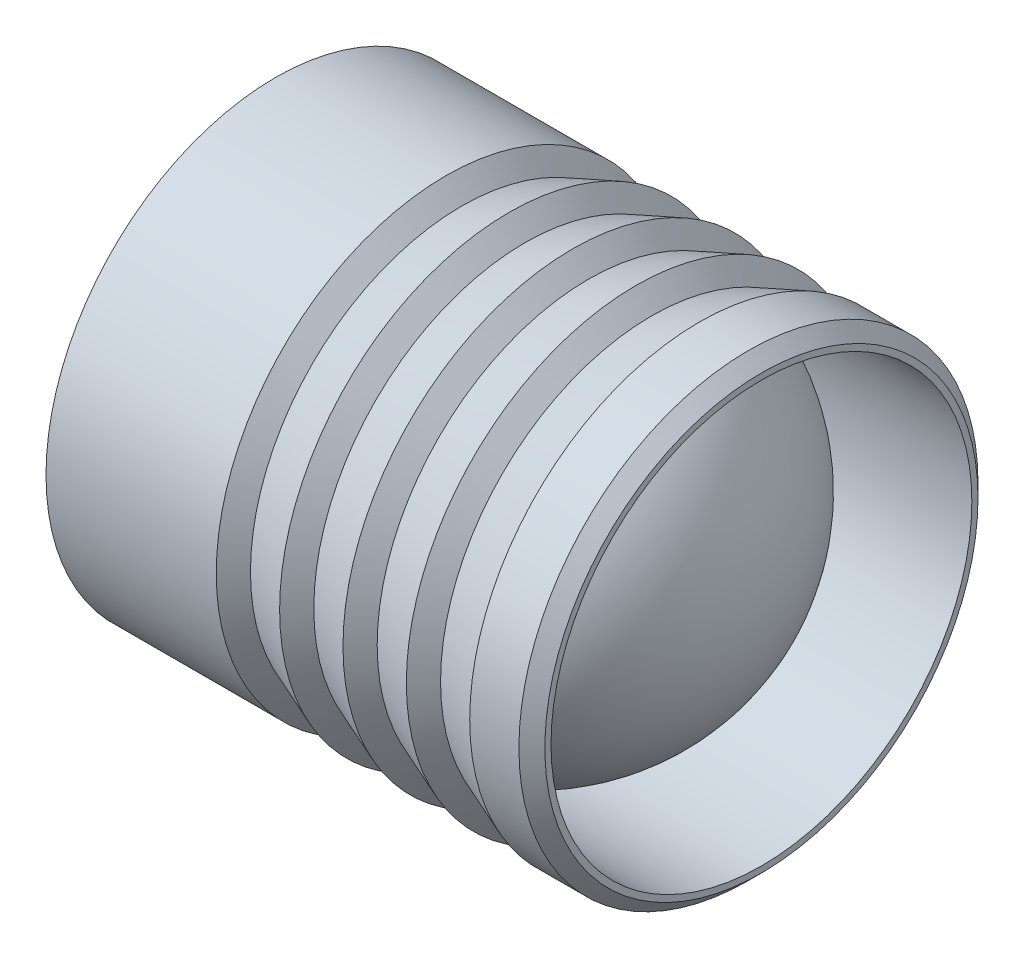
ISO-10303-21;
HEADER;
FILE_DESCRIPTION(('STEP AP214'),'2;1');
FILE_NAME('part.step','',(''),(''),'','','');
FILE_SCHEMA(('AUTOMOTIVE_DESIGN { 1 0 10303 214 1 1 1 1 }'));
ENDSEC;
DATA;
#1=APPLICATION_CONTEXT('core data for automotive mechanical design processes');
#2=APPLICATION_PROTOCOL_DEFINITION('international standard','automotive_design',2000,#1);
#3=PRODUCT_CONTEXT('',#1,'mechanical');
#4=PRODUCT('Part','Part','',(#3));
#5=PRODUCT_RELATED_PRODUCT_CATEGORY('part','',(#4));
#6=PRODUCT_DEFINITION_FORMATION('','',#4);
#7=PRODUCT_DEFINITION_CONTEXT('part definition',#1,'design');
#8=PRODUCT_DEFINITION('design','',#6,#7);
#9=PRODUCT_DEFINITION_SHAPE('','',#8);
#10=(LENGTH_UNIT() NAMED_UNIT(*) SI_UNIT(.MILLI.,.METRE.));
#11=(NAMED_UNIT(*) PLANE_ANGLE_UNIT() SI_UNIT($,.RADIAN.));
#12=(NAMED_UNIT(*) SI_UNIT($,.STERADIAN.) SOLID_ANGLE_UNIT());
#13=UNCERTAINTY_MEASURE_WITH_UNIT(LENGTH_MEASURE(1.E-05),#10,'distance_accuracy_value','');
#14=(GEOMETRIC_REPRESENTATION_CONTEXT(3) GLOBAL_UNCERTAINTY_ASSIGNED_CONTEXT((#13)) GLOBAL_UNIT_ASSIGNED_CONTEXT((#10,
#11,#12)) REPRESENTATION_CONTEXT('',''));
#15=CARTESIAN_POINT('',(0.,0.,0.));
#16=DIRECTION('',(0.,0.,1.));
#17=DIRECTION('',(1.,0.,0.));
#18=AXIS2_PLACEMENT_3D('',#15,#16,#17);
#19=CARTESIAN_POINT('',(7.09,0.,0.));
#20=DIRECTION('',(1.,0.,0.));
#21=DIRECTION('',(0.,-1.,0.));
#22=AXIS2_PLACEMENT_3D('',#19,#20,#21);
#23=SPHERICAL_SURFACE('',#22,5.51);
#24=CARTESIAN_POINT('',(7.42181485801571,0.,0.));
#25=DIRECTION('',(-1.,0.,0.));
#26=DIRECTION('',(0.,0.,1.));
#27=AXIS2_PLACEMENT_3D('',#24,#25,#26);
#28=CIRCLE('',#27,5.4999999);
#29=CARTESIAN_POINT('',(7.42181485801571,0.,5.4999999));
#30=VERTEX_POINT('',#29);
#31=EDGE_CURVE('E41',#30,#30,#28,.T.);
#32=ORIENTED_EDGE('',*,*,#31,.F.);
#33=EDGE_LOOP('',(#32));
#34=FACE_BOUND('',#33,.T.);
#35=CARTESIAN_POINT('',(12.6,0.,0.));
#36=VERTEX_POINT('',#35);
#37=VERTEX_LOOP('',#36);
#38=FACE_BOUND('',#37,.T.);
#39=ADVANCED_FACE('F18',(#34,#38),#23,.T.);
#40=CARTESIAN_POINT('',(13.,5.66058874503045,0.));
#41=DIRECTION('',(-1.,0.,0.));
#42=DIRECTION('',(0.,0.,1.));
#43=AXIS2_PLACEMENT_3D('',#40,#41,#42);
#44=PLANE('',#43);
#45=CARTESIAN_POINT('',(13.,0.,0.));
#46=DIRECTION('',(1.,0.,0.));
#47=DIRECTION('',(0.,0.,-1.));
#48=AXIS2_PLACEMENT_3D('',#45,#46,#47);
#49=CIRCLE('',#48,5.660588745);
#50=CARTESIAN_POINT('',(13.,0.,-5.66058874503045));
#51=VERTEX_POINT('',#50);
#52=EDGE_CURVE('E11',#51,#51,#49,.T.);
#53=ORIENTED_EDGE('',*,*,#52,.T.);
#54=EDGE_LOOP('',(#53));
#55=FACE_BOUND('',#54,.T.);
#56=CARTESIAN_POINT('',(13.,0.,0.));
#57=DIRECTION('',(1.,0.,0.));
#58=DIRECTION('',(0.,0.,-1.));
#59=AXIS2_PLACEMENT_3D('',#56,#57,#58);
#60=CIRCLE('',#59,5.4999999);
#61=CARTESIAN_POINT('',(13.,0.,-5.4999999));
#62=VERTEX_POINT('',#61);
#63=EDGE_CURVE('E29',#62,#62,#60,.T.);
#64=ORIENTED_EDGE('',*,*,#63,.F.);
#65=EDGE_LOOP('',(#64));
#66=FACE_BOUND('',#65,.T.);
#67=ADVANCED_FACE('F196',(#55,#66),#44,.F.);
#68=CARTESIAN_POINT('',(13.,0.,0.));
#69=DIRECTION('',(-1.,0.,0.));
#70=DIRECTION('',(0.,0.,-1.));
#71=AXIS2_PLACEMENT_3D('',#68,#69,#70);
#72=CYLINDRICAL_SURFACE('',#71,5.4999999);
#73=ORIENTED_EDGE('',*,*,#63,.T.);
#74=EDGE_LOOP('',(#73));
#75=FACE_BOUND('',#74,.T.);
#76=ORIENTED_EDGE('',*,*,#31,.T.);
#77=EDGE_LOOP('',(#76));
#78=FACE_BOUND('',#77,.T.);
#79=ADVANCED_FACE('F193',(#75,#78),#72,.F.);
#80=CARTESIAN_POINT('',(0.,0.,0.));
#81=DIRECTION('',(1.,0.,0.));
#82=DIRECTION('',(0.,1.,0.));
#83=AXIS2_PLACEMENT_3D('',#80,#81,#82);
#84=PLANE('',#83);
#85=CARTESIAN_POINT('',(0.,0.,0.));
#86=DIRECTION('',(1.,0.,0.));
#87=DIRECTION('',(0.,0.,-1.));
#88=AXIS2_PLACEMENT_3D('',#85,#86,#87);
#89=CIRCLE('',#88,5.4803847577);
#90=CARTESIAN_POINT('',(0.,0.,-5.48038475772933));
#91=VERTEX_POINT('',#90);
#92=EDGE_CURVE('E146',#91,#91,#89,.T.);
#93=ORIENTED_EDGE('',*,*,#92,.F.);
#94=EDGE_LOOP('',(#93));
#95=FACE_BOUND('',#94,.T.);
#96=ADVANCED_FACE('F147',(#95),#84,.F.);
#97=CARTESIAN_POINT('',(12.6605887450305,0.,0.));
#98=DIRECTION('',(-1.,0.,0.));
#99=DIRECTION('',(0.,0.,1.));
#100=AXIS2_PLACEMENT_3D('',#97,#98,#99);
#101=CONICAL_SURFACE('',#100,6.,0.7853981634);
#102=CARTESIAN_POINT('',(12.6605887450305,0.,0.));
#103=DIRECTION('',(1.,0.,0.));
#104=DIRECTION('',(0.,0.,-1.));
#105=AXIS2_PLACEMENT_3D('',#102,#103,#104);
#106=CIRCLE('',#105,6.);
#107=CARTESIAN_POINT('',(12.6605887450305,0.,-6.));
#108=VERTEX_POINT('',#107);
#109=EDGE_CURVE('E141',#108,#108,#106,.T.);
#110=ORIENTED_EDGE('',*,*,#109,.T.);
#111=EDGE_LOOP('',(#110));
#112=FACE_BOUND('',#111,.T.);
#113=ORIENTED_EDGE('',*,*,#52,.F.);
#114=EDGE_LOOP('',(#113));
#115=FACE_BOUND('',#114,.T.);
#116=ADVANCED_FACE('F238',(#112,#115),#101,.T.);
#117=CARTESIAN_POINT('',(13.,0.,0.));
#118=DIRECTION('',(-1.,0.,0.));
#119=DIRECTION('',(0.,0.,-1.));
#120=AXIS2_PLACEMENT_3D('',#117,#118,#119);
#121=CYLINDRICAL_SURFACE('',#120,6.);
#122=CARTESIAN_POINT('',(11.375,0.,0.));
#123=DIRECTION('',(1.,0.,0.));
#124=DIRECTION('',(0.,0.,-1.));
#125=AXIS2_PLACEMENT_3D('',#122,#123,#124);
#126=CIRCLE('',#125,6.);
#127=CARTESIAN_POINT('',(11.375,0.,-6.));
#128=VERTEX_POINT('',#127);
#129=EDGE_CURVE('E159',#128,#128,#126,.T.);
#130=ORIENTED_EDGE('',*,*,#129,.T.);
#131=EDGE_LOOP('',(#130));
#132=FACE_BOUND('',#131,.T.);
#133=ORIENTED_EDGE('',*,*,#109,.F.);
#134=EDGE_LOOP('',(#133));
#135=FACE_BOUND('',#134,.T.);
#136=ADVANCED_FACE('F209',(#132,#135),#121,.T.);
#137=CARTESIAN_POINT('',(10.1328125,0.,0.));
#138=DIRECTION('',(1.,0.,0.));
#139=DIRECTION('',(0.,0.,-1.));
#140=AXIS2_PLACEMENT_3D('',#137,#138,#139);
#141=CONICAL_SURFACE('',#140,5.52,0.3687406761);
#142=ORIENTED_EDGE('',*,*,#129,.F.);
#143=EDGE_LOOP('',(#142));
#144=FACE_BOUND('',#143,.T.);
#145=CARTESIAN_POINT('',(10.1328125,0.,0.));
#146=DIRECTION('',(1.,0.,0.));
#147=DIRECTION('',(0.,0.,-1.));
#148=AXIS2_PLACEMENT_3D('',#145,#146,#147);
#149=CIRCLE('',#148,5.52);
#150=CARTESIAN_POINT('',(10.1328125,0.,-5.52));
#151=VERTEX_POINT('',#150);
#152=EDGE_CURVE('E162',#151,#151,#149,.T.);
#153=ORIENTED_EDGE('',*,*,#152,.T.);
#154=EDGE_LOOP('',(#153));
#155=FACE_BOUND('',#154,.T.);
#156=ADVANCED_FACE('F245',(#144,#155),#141,.T.);
#157=CARTESIAN_POINT('',(9.71875,0.,0.));
#158=DIRECTION('',(-1.,0.,0.));
#159=DIRECTION('',(0.,0.,1.));
#160=AXIS2_PLACEMENT_3D('',#157,#158,#159);
#161=CONICAL_SURFACE('',#160,6.,0.8590153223);
#162=CARTESIAN_POINT('',(9.71875,0.,0.));
#163=DIRECTION('',(1.,0.,0.));
#164=DIRECTION('',(0.,0.,-1.));
#165=AXIS2_PLACEMENT_3D('',#162,#163,#164);
#166=CIRCLE('',#165,6.);
#167=CARTESIAN_POINT('',(9.71875,0.,-6.));
#168=VERTEX_POINT('',#167);
#169=EDGE_CURVE('E131',#168,#168,#166,.T.);
#170=ORIENTED_EDGE('',*,*,#169,.T.);
#171=EDGE_LOOP('',(#170));
#172=FACE_BOUND('',#171,.T.);
#173=ORIENTED_EDGE('',*,*,#152,.F.);
#174=EDGE_LOOP('',(#173));
#175=FACE_BOUND('',#174,.T.);
#176=ADVANCED_FACE('F20',(#172,#175),#161,.T.);
#177=CARTESIAN_POINT('',(8.4765625,0.,0.));
#178=DIRECTION('',(1.,0.,0.));
#179=DIRECTION('',(0.,0.,-1.));
#180=AXIS2_PLACEMENT_3D('',#177,#178,#179);
#181=CONICAL_SURFACE('',#180,5.52,0.3687406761);
#182=ORIENTED_EDGE('',*,*,#169,.F.);
#183=EDGE_LOOP('',(#182));
#184=FACE_BOUND('',#183,.T.);
#185=CARTESIAN_POINT('',(8.4765625,0.,0.));
#186=DIRECTION('',(1.,0.,0.));
#187=DIRECTION('',(0.,0.,-1.));
#188=AXIS2_PLACEMENT_3D('',#185,#186,#187);
#189=CIRCLE('',#188,5.52);
#190=CARTESIAN_POINT('',(8.4765625,0.,-5.52));
#191=VERTEX_POINT('',#190);
#192=EDGE_CURVE('E123',#191,#191,#189,.T.);
#193=ORIENTED_EDGE('',*,*,#192,.T.);
#194=EDGE_LOOP('',(#193));
#195=FACE_BOUND('',#194,.T.);
#196=ADVANCED_FACE('F220',(#184,#195),#181,.T.);
#197=CARTESIAN_POINT('',(8.0625,0.,0.));
#198=DIRECTION('',(-1.,0.,0.));
#199=DIRECTION('',(0.,0.,1.));
#200=AXIS2_PLACEMENT_3D('',#197,#198,#199);
#201=CONICAL_SURFACE('',#200,6.,0.8590153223);
#202=CARTESIAN_POINT('',(8.0625,0.,0.));
#203=DIRECTION('',(1.,0.,0.));
#204=DIRECTION('',(0.,0.,-1.));
#205=AXIS2_PLACEMENT_3D('',#202,#203,#204);
#206=CIRCLE('',#205,6.);
#207=CARTESIAN_POINT('',(8.0625,0.,-6.));
#208=VERTEX_POINT('',#207);
#209=EDGE_CURVE('E171',#208,#208,#206,.T.);
#210=ORIENTED_EDGE('',*,*,#209,.T.);
#211=EDGE_LOOP('',(#210));
#212=FACE_BOUND('',#211,.T.);
#213=ORIENTED_EDGE('',*,*,#192,.F.);
#214=EDGE_LOOP('',(#213));
#215=FACE_BOUND('',#214,.T.);
#216=ADVANCED_FACE('F223',(#212,#215),#201,.T.);
#217=CARTESIAN_POINT('',(6.8203125,0.,0.));
#218=DIRECTION('',(1.,0.,0.));
#219=DIRECTION('',(0.,0.,-1.));
#220=AXIS2_PLACEMENT_3D('',#217,#218,#219);
#221=CONICAL_SURFACE('',#220,5.52,0.3687406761);
#222=ORIENTED_EDGE('',*,*,#209,.F.);
#223=EDGE_LOOP('',(#222));
#224=FACE_BOUND('',#223,.T.);
#225=CARTESIAN_POINT('',(6.8203125,0.,0.));
#226=DIRECTION('',(1.,0.,0.));
#227=DIRECTION('',(0.,0.,-1.));
#228=AXIS2_PLACEMENT_3D('',#225,#226,#227);
#229=CIRCLE('',#228,5.52);
#230=CARTESIAN_POINT('',(6.8203125,0.,-5.52));
#231=VERTEX_POINT('',#230);
#232=EDGE_CURVE('E175',#231,#231,#229,.T.);
#233=ORIENTED_EDGE('',*,*,#232,.T.);
#234=EDGE_LOOP('',(#233));
#235=FACE_BOUND('',#234,.T.);
#236=ADVANCED_FACE('F226',(#224,#235),#221,.T.);
#237=CARTESIAN_POINT('',(6.40625,0.,0.));
#238=DIRECTION('',(-1.,0.,0.));
#239=DIRECTION('',(0.,0.,1.));
#240=AXIS2_PLACEMENT_3D('',#237,#238,#239);
#241=CONICAL_SURFACE('',#240,6.,0.8590153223);
#242=CARTESIAN_POINT('',(6.40625,0.,0.));
#243=DIRECTION('',(1.,0.,0.));
#244=DIRECTION('',(0.,0.,-1.));
#245=AXIS2_PLACEMENT_3D('',#242,#243,#244);
#246=CIRCLE('',#245,6.);
#247=CARTESIAN_POINT('',(6.40625,0.,-6.));
#248=VERTEX_POINT('',#247);
#249=EDGE_CURVE('E103',#248,#248,#246,.T.);
#250=ORIENTED_EDGE('',*,*,#249,.T.);
#251=EDGE_LOOP('',(#250));
#252=FACE_BOUND('',#251,.T.);
#253=ORIENTED_EDGE('',*,*,#232,.F.);
#254=EDGE_LOOP('',(#253));
#255=FACE_BOUND('',#254,.T.);
#256=ADVANCED_FACE('F243',(#252,#255),#241,.T.);
#257=CARTESIAN_POINT('',(5.1640625,0.,0.));
#258=DIRECTION('',(1.,0.,0.));
#259=DIRECTION('',(0.,0.,-1.));
#260=AXIS2_PLACEMENT_3D('',#257,#258,#259);
#261=CONICAL_SURFACE('',#260,5.52,0.3687406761);
#262=ORIENTED_EDGE('',*,*,#249,.F.);
#263=EDGE_LOOP('',(#262));
#264=FACE_BOUND('',#263,.T.);
#265=CARTESIAN_POINT('',(5.1640625,0.,0.));
#266=DIRECTION('',(1.,0.,0.));
#267=DIRECTION('',(0.,0.,-1.));
#268=AXIS2_PLACEMENT_3D('',#265,#266,#267);
#269=CIRCLE('',#268,5.52);
#270=CARTESIAN_POINT('',(5.1640625,0.,-5.52));
#271=VERTEX_POINT('',#270);
#272=EDGE_CURVE('E112',#271,#271,#269,.T.);
#273=ORIENTED_EDGE('',*,*,#272,.T.);
#274=EDGE_LOOP('',(#273));
#275=FACE_BOUND('',#274,.T.);
#276=ADVANCED_FACE('F214',(#264,#275),#261,.T.);
#277=CARTESIAN_POINT('',(4.75,0.,0.));
#278=DIRECTION('',(-1.,0.,0.));
#279=DIRECTION('',(0.,0.,1.));
#280=AXIS2_PLACEMENT_3D('',#277,#278,#279);
#281=CONICAL_SURFACE('',#280,6.,0.8590153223);
#282=CARTESIAN_POINT('',(4.75,0.,0.));
#283=DIRECTION('',(1.,0.,0.));
#284=DIRECTION('',(0.,0.,-1.));
#285=AXIS2_PLACEMENT_3D('',#282,#283,#284);
#286=CIRCLE('',#285,6.);
#287=CARTESIAN_POINT('',(4.75,0.,-6.));
#288=VERTEX_POINT('',#287);
#289=EDGE_CURVE('E154',#288,#288,#286,.T.);
#290=ORIENTED_EDGE('',*,*,#289,.T.);
#291=EDGE_LOOP('',(#290));
#292=FACE_BOUND('',#291,.T.);
#293=ORIENTED_EDGE('',*,*,#272,.F.);
#294=EDGE_LOOP('',(#293));
#295=FACE_BOUND('',#294,.T.);
#296=ADVANCED_FACE('F211',(#292,#295),#281,.T.);
#297=CARTESIAN_POINT('',(13.,0.,0.));
#298=DIRECTION('',(-1.,0.,0.));
#299=DIRECTION('',(0.,0.,-1.));
#300=AXIS2_PLACEMENT_3D('',#297,#298,#299);
#301=CYLINDRICAL_SURFACE('',#300,6.);
#302=CARTESIAN_POINT('',(0.3,0.,0.));
#303=DIRECTION('',(1.,0.,0.));
#304=DIRECTION('',(0.,0.,-1.));
#305=AXIS2_PLACEMENT_3D('',#302,#303,#304);
#306=CIRCLE('',#305,6.);
#307=CARTESIAN_POINT('',(0.3,0.,-6.));
#308=VERTEX_POINT('',#307);
#309=EDGE_CURVE('E61',#308,#308,#306,.T.);
#310=ORIENTED_EDGE('',*,*,#309,.T.);
#311=EDGE_LOOP('',(#310));
#312=FACE_BOUND('',#311,.T.);
#313=ORIENTED_EDGE('',*,*,#289,.F.);
#314=EDGE_LOOP('',(#313));
#315=FACE_BOUND('',#314,.T.);
#316=ADVANCED_FACE('F213',(#312,#315),#301,.T.);
#317=CARTESIAN_POINT('',(0.,0.,0.));
#318=DIRECTION('',(1.,0.,0.));
#319=DIRECTION('',(0.,0.,-1.));
#320=AXIS2_PLACEMENT_3D('',#317,#318,#319);
#321=CONICAL_SURFACE('',#320,5.4803847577,1.0471975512);
#322=ORIENTED_EDGE('',*,*,#309,.F.);
#323=EDGE_LOOP('',(#322));
#324=FACE_BOUND('',#323,.T.);
#325=ORIENTED_EDGE('',*,*,#92,.T.);
#326=EDGE_LOOP('',(#325));
#327=FACE_BOUND('',#326,.T.);
#328=ADVANCED_FACE('F217',(#324,#327),#321,.T.);
#329=CLOSED_SHELL('',(#39,#67,#79,#96,#116,#136,#156,#176,#196,#216,#236,#256,#276,#296,#316,#328));
#330=CARTESIAN_POINT('',(3.82542642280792,0.,0.));
#331=DIRECTION('',(1.,0.,0.));
#332=DIRECTION('',(0.,0.,-1.));
#333=AXIS2_PLACEMENT_3D('',#330,#331,#332);
#334=CONICAL_SURFACE('',#333,5.4999999,1.0471975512);
#335=CARTESIAN_POINT('',(3.82542642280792,0.,0.));
#336=DIRECTION('',(1.,0.,0.));
#337=DIRECTION('',(0.,0.,-1.));
#338=AXIS2_PLACEMENT_3D('',#335,#336,#337);
#339=CIRCLE('',#338,5.4999999);
#340=CARTESIAN_POINT('',(3.82542642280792,0.,-5.4999999));
#341=VERTEX_POINT('',#340);
#342=EDGE_CURVE('E72',#341,#341,#339,.T.);
#343=ORIENTED_EDGE('',*,*,#342,.T.);
#344=EDGE_LOOP('',(#343));
#345=FACE_BOUND('',#344,.T.);
#346=CARTESIAN_POINT('',(0.65,0.,0.));
#347=VERTEX_POINT('',#346);
#348=VERTEX_LOOP('',#347);
#349=FACE_BOUND('',#348,.T.);
#350=ADVANCED_FACE('F232',(#345,#349),#334,.F.);
#351=CARTESIAN_POINT('',(7.09,0.,0.));
#352=DIRECTION('',(1.,0.,0.));
#353=DIRECTION('',(0.,-1.,0.));
#354=AXIS2_PLACEMENT_3D('',#351,#352,#353);
#355=SPHERICAL_SURFACE('',#354,5.51);
#356=CARTESIAN_POINT('',(6.7581851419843,0.,0.));
#357=DIRECTION('',(1.,0.,0.));
#358=DIRECTION('',(0.,0.,-1.));
#359=AXIS2_PLACEMENT_3D('',#356,#357,#358);
#360=CIRCLE('',#359,5.4999999);
#361=CARTESIAN_POINT('',(6.7581851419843,0.,-5.4999999));
#362=VERTEX_POINT('',#361);
#363=EDGE_CURVE('E22',#362,#362,#360,.T.);
#364=ORIENTED_EDGE('',*,*,#363,.F.);
#365=EDGE_LOOP('',(#364));
#366=FACE_BOUND('',#365,.T.);
#367=CARTESIAN_POINT('',(1.58,0.,0.));
#368=VERTEX_POINT('',#367);
#369=VERTEX_LOOP('',#368);
#370=FACE_BOUND('',#369,.T.);
#371=ADVANCED_FACE('F228',(#366,#370),#355,.T.);
#372=CARTESIAN_POINT('',(13.,0.,0.));
#373=DIRECTION('',(-1.,0.,0.));
#374=DIRECTION('',(0.,0.,-1.));
#375=AXIS2_PLACEMENT_3D('',#372,#373,#374);
#376=CYLINDRICAL_SURFACE('',#375,5.4999999);
#377=ORIENTED_EDGE('',*,*,#363,.T.);
#378=EDGE_LOOP('',(#377));
#379=FACE_BOUND('',#378,.T.);
#380=ORIENTED_EDGE('',*,*,#342,.F.);
#381=EDGE_LOOP('',(#380));
#382=FACE_BOUND('',#381,.T.);
#383=ADVANCED_FACE('F231',(#379,#382),#376,.F.);
#384=CLOSED_SHELL('',(#350,#371,#383));
#385=ORIENTED_CLOSED_SHELL('',*,#384,.T.);
#386=BREP_WITH_VOIDS('B1',#329,(#385));
#387=ADVANCED_BREP_SHAPE_REPRESENTATION('',(#18,#386),#14);
#388=SHAPE_DEFINITION_REPRESENTATION(#9,#387);
ENDSEC;
END-ISO-10303-21;
